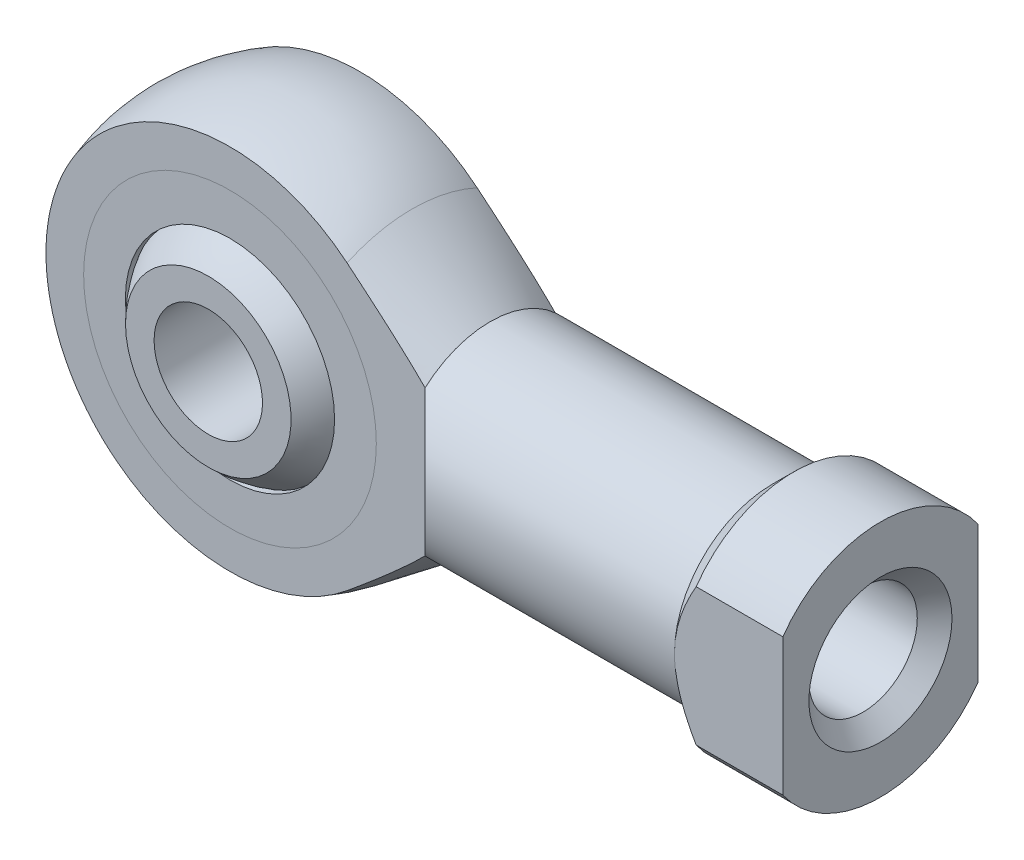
ISO-10303-21;
HEADER;
FILE_DESCRIPTION(('STEP AP214'),'2;1');
FILE_NAME('part.step','',(''),(''),'','','');
FILE_SCHEMA(('AUTOMOTIVE_DESIGN { 1 0 10303 214 1 1 1 1 }'));
ENDSEC;
DATA;
#1=APPLICATION_CONTEXT('core data for automotive mechanical design processes');
#2=APPLICATION_PROTOCOL_DEFINITION('international standard','automotive_design',2000,#1);
#3=PRODUCT_CONTEXT('',#1,'mechanical');
#4=PRODUCT('Part','Part','',(#3));
#5=PRODUCT_RELATED_PRODUCT_CATEGORY('part','',(#4));
#6=PRODUCT_DEFINITION_FORMATION('','',#4);
#7=PRODUCT_DEFINITION_CONTEXT('part definition',#1,'design');
#8=PRODUCT_DEFINITION('design','',#6,#7);
#9=PRODUCT_DEFINITION_SHAPE('','',#8);
#10=(LENGTH_UNIT() NAMED_UNIT(*) SI_UNIT(.MILLI.,.METRE.));
#11=(NAMED_UNIT(*) PLANE_ANGLE_UNIT() SI_UNIT($,.RADIAN.));
#12=(NAMED_UNIT(*) SI_UNIT($,.STERADIAN.) SOLID_ANGLE_UNIT());
#13=UNCERTAINTY_MEASURE_WITH_UNIT(LENGTH_MEASURE(1.E-05),#10,'distance_accuracy_value','');
#14=(GEOMETRIC_REPRESENTATION_CONTEXT(3) GLOBAL_UNCERTAINTY_ASSIGNED_CONTEXT((#13)) GLOBAL_UNIT_ASSIGNED_CONTEXT((#10,
#11,#12)) REPRESENTATION_CONTEXT('',''));
#15=CARTESIAN_POINT('',(0.,0.,0.));
#16=DIRECTION('',(0.,0.,1.));
#17=DIRECTION('',(1.,0.,0.));
#18=AXIS2_PLACEMENT_3D('',#15,#16,#17);
#19=CARTESIAN_POINT('',(0.,0.,0.));
#20=DIRECTION('',(0.,1.,0.));
#21=DIRECTION('',(1.,0.,0.));
#22=AXIS2_PLACEMENT_3D('',#19,#20,#21);
#23=SPHERICAL_SURFACE('',#22,5.53);
#24=CARTESIAN_POINT('',(0.,0.,0.));
#25=DIRECTION('',(0.,0.,-1.));
#26=DIRECTION('',(-1.,0.,0.));
#27=AXIS2_PLACEMENT_3D('',#24,#25,#26);
#28=SPHERICAL_SURFACE('',#27,5.53);
#29=CARTESIAN_POINT('',(0.,0.,4.));
#30=DIRECTION('',(0.,0.,-1.));
#31=DIRECTION('',(-1.,0.,0.));
#32=AXIS2_PLACEMENT_3D('',#29,#30,#31);
#33=CIRCLE('',#32,3.81849446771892);
#34=CARTESIAN_POINT('',(-3.81849446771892,0.,4.));
#35=VERTEX_POINT('',#34);
#36=EDGE_CURVE('P0_E26',#35,#35,#33,.F.);
#37=ORIENTED_EDGE('',*,*,#36,.F.);
#38=EDGE_LOOP('',(#37));
#39=FACE_BOUND('',#38,.T.);
#40=CARTESIAN_POINT('',(0.,0.,-4.));
#41=DIRECTION('',(0.,0.,1.));
#42=DIRECTION('',(1.,0.,0.));
#43=AXIS2_PLACEMENT_3D('',#40,#41,#42);
#44=CIRCLE('',#43,3.81849446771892);
#45=CARTESIAN_POINT('',(3.81849446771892,0.,-4.));
#46=VERTEX_POINT('',#45);
#47=EDGE_CURVE('P0_E10',#46,#46,#44,.F.);
#48=ORIENTED_EDGE('',*,*,#47,.F.);
#49=EDGE_LOOP('',(#48));
#50=FACE_BOUND('',#49,.T.);
#51=ADVANCED_FACE('P0_F14',(#39,#50),#28,.T.);
#52=CARTESIAN_POINT('',(0.,0.,-5.53));
#53=DIRECTION('',(0.,0.,1.));
#54=DIRECTION('',(1.,0.,0.));
#55=AXIS2_PLACEMENT_3D('',#52,#53,#54);
#56=CYLINDRICAL_SURFACE('',#55,2.5);
#57=CARTESIAN_POINT('',(0.,0.,4.));
#58=DIRECTION('',(0.,0.,-1.));
#59=DIRECTION('',(-1.,0.,0.));
#60=AXIS2_PLACEMENT_3D('',#57,#58,#59);
#61=CIRCLE('',#60,2.5);
#62=CARTESIAN_POINT('',(-2.5,0.,4.));
#63=VERTEX_POINT('',#62);
#64=EDGE_CURVE('P0_E17',#63,#63,#61,.F.);
#65=ORIENTED_EDGE('',*,*,#64,.T.);
#66=EDGE_LOOP('',(#65));
#67=FACE_BOUND('',#66,.T.);
#68=CARTESIAN_POINT('',(0.,0.,-4.));
#69=DIRECTION('',(0.,0.,1.));
#70=DIRECTION('',(1.,0.,0.));
#71=AXIS2_PLACEMENT_3D('',#68,#69,#70);
#72=CIRCLE('',#71,2.5);
#73=CARTESIAN_POINT('',(2.5,0.,-4.));
#74=VERTEX_POINT('',#73);
#75=EDGE_CURVE('P0_E21',#74,#74,#72,.F.);
#76=ORIENTED_EDGE('',*,*,#75,.T.);
#77=EDGE_LOOP('',(#76));
#78=FACE_BOUND('',#77,.T.);
#79=ADVANCED_FACE('P0_F34',(#67,#78),#56,.F.);
#80=CARTESIAN_POINT('',(-5.53,-5.53,-4.));
#81=DIRECTION('',(0.,0.,1.));
#82=DIRECTION('',(1.,0.,0.));
#83=AXIS2_PLACEMENT_3D('',#80,#81,#82);
#84=PLANE('',#83);
#85=ORIENTED_EDGE('',*,*,#47,.T.);
#86=EDGE_LOOP('',(#85));
#87=FACE_BOUND('',#86,.T.);
#88=ORIENTED_EDGE('',*,*,#75,.F.);
#89=EDGE_LOOP('',(#88));
#90=FACE_BOUND('',#89,.T.);
#91=ADVANCED_FACE('P0_F39',(#87,#90),#84,.F.);
#92=CARTESIAN_POINT('',(-5.53,-5.53,4.));
#93=DIRECTION('',(0.,0.,-1.));
#94=DIRECTION('',(-1.,0.,0.));
#95=AXIS2_PLACEMENT_3D('',#92,#93,#94);
#96=PLANE('',#95);
#97=ORIENTED_EDGE('',*,*,#36,.T.);
#98=EDGE_LOOP('',(#97));
#99=FACE_BOUND('',#98,.T.);
#100=ORIENTED_EDGE('',*,*,#64,.F.);
#101=EDGE_LOOP('',(#100));
#102=FACE_BOUND('',#101,.T.);
#103=ADVANCED_FACE('P0_F37',(#99,#102),#96,.F.);
#104=CLOSED_SHELL('',(#51,#79,#91,#103));
#105=MANIFOLD_SOLID_BREP('P0_B1',#104);
#106=CARTESIAN_POINT('',(0.,0.,3.));
#107=DIRECTION('',(0.,0.,1.));
#108=DIRECTION('',(1.,0.,0.));
#109=AXIS2_PLACEMENT_3D('',#106,#107,#108);
#110=PLANE('',#109);
#111=CARTESIAN_POINT('',(0.,0.,3.));
#112=DIRECTION('',(0.,0.,1.));
#113=DIRECTION('',(1.,0.,0.));
#114=AXIS2_PLACEMENT_3D('',#111,#112,#113);
#115=CIRCLE('',#114,6.75);
#116=CARTESIAN_POINT('',(6.75,0.,3.));
#117=VERTEX_POINT('',#116);
#118=EDGE_CURVE('P1_E10',#117,#117,#115,.T.);
#119=ORIENTED_EDGE('',*,*,#118,.T.);
#120=EDGE_LOOP('',(#119));
#121=FACE_BOUND('',#120,.T.);
#122=CARTESIAN_POINT('',(0.,0.,3.));
#123=DIRECTION('',(0.,0.,1.));
#124=DIRECTION('',(1.,0.,0.));
#125=AXIS2_PLACEMENT_3D('',#122,#123,#124);
#126=CIRCLE('',#125,4.825);
#127=CARTESIAN_POINT('',(4.825,0.,3.));
#128=VERTEX_POINT('',#127);
#129=EDGE_CURVE('P1_E25',#128,#128,#126,.T.);
#130=ORIENTED_EDGE('',*,*,#129,.F.);
#131=EDGE_LOOP('',(#130));
#132=FACE_BOUND('',#131,.T.);
#133=ADVANCED_FACE('P1_F14',(#121,#132),#110,.T.);
#134=CARTESIAN_POINT('',(0.,0.,2.7));
#135=DIRECTION('',(0.,0.,1.));
#136=DIRECTION('',(1.,0.,0.));
#137=AXIS2_PLACEMENT_3D('',#134,#135,#136);
#138=PLANE('',#137);
#139=CARTESIAN_POINT('',(0.,0.,2.7));
#140=DIRECTION('',(0.,0.,1.));
#141=DIRECTION('',(1.,0.,0.));
#142=AXIS2_PLACEMENT_3D('',#139,#140,#141);
#143=CIRCLE('',#142,6.75);
#144=CARTESIAN_POINT('',(6.75,0.,2.7));
#145=VERTEX_POINT('',#144);
#146=EDGE_CURVE('P1_E18',#145,#145,#143,.T.);
#147=ORIENTED_EDGE('',*,*,#146,.F.);
#148=EDGE_LOOP('',(#147));
#149=FACE_BOUND('',#148,.T.);
#150=CARTESIAN_POINT('',(0.,0.,2.7));
#151=DIRECTION('',(0.,0.,1.));
#152=DIRECTION('',(1.,0.,0.));
#153=AXIS2_PLACEMENT_3D('',#150,#151,#152);
#154=CIRCLE('',#153,4.825);
#155=CARTESIAN_POINT('',(4.825,0.,2.7));
#156=VERTEX_POINT('',#155);
#157=EDGE_CURVE('P1_E27',#156,#156,#154,.T.);
#158=ORIENTED_EDGE('',*,*,#157,.T.);
#159=EDGE_LOOP('',(#158));
#160=FACE_BOUND('',#159,.T.);
#161=ADVANCED_FACE('P1_F37',(#149,#160),#138,.F.);
#162=CARTESIAN_POINT('',(0.,0.,3.));
#163=DIRECTION('',(0.,0.,-1.));
#164=DIRECTION('',(-1.,0.,0.));
#165=AXIS2_PLACEMENT_3D('',#162,#163,#164);
#166=CYLINDRICAL_SURFACE('',#165,6.75);
#167=ORIENTED_EDGE('',*,*,#118,.F.);
#168=EDGE_LOOP('',(#167));
#169=FACE_BOUND('',#168,.T.);
#170=ORIENTED_EDGE('',*,*,#146,.T.);
#171=EDGE_LOOP('',(#170));
#172=FACE_BOUND('',#171,.T.);
#173=ADVANCED_FACE('P1_F16',(#169,#172),#166,.T.);
#174=CARTESIAN_POINT('',(0.,0.,3.));
#175=DIRECTION('',(0.,0.,-1.));
#176=DIRECTION('',(-1.,0.,0.));
#177=AXIS2_PLACEMENT_3D('',#174,#175,#176);
#178=CYLINDRICAL_SURFACE('',#177,4.825);
#179=ORIENTED_EDGE('',*,*,#129,.T.);
#180=EDGE_LOOP('',(#179));
#181=FACE_BOUND('',#180,.T.);
#182=ORIENTED_EDGE('',*,*,#157,.F.);
#183=EDGE_LOOP('',(#182));
#184=FACE_BOUND('',#183,.T.);
#185=ADVANCED_FACE('P1_F33',(#181,#184),#178,.F.);
#186=CLOSED_SHELL('',(#133,#161,#173,#185));
#187=MANIFOLD_SOLID_BREP('P1_B1',#186);
#188=CARTESIAN_POINT('',(0.,0.,-2.7));
#189=DIRECTION('',(0.,0.,1.));
#190=DIRECTION('',(1.,0.,0.));
#191=AXIS2_PLACEMENT_3D('',#188,#189,#190);
#192=PLANE('',#191);
#193=CARTESIAN_POINT('',(0.,0.,-2.7));
#194=DIRECTION('',(0.,0.,1.));
#195=DIRECTION('',(1.,0.,0.));
#196=AXIS2_PLACEMENT_3D('',#193,#194,#195);
#197=CIRCLE('',#196,6.75);
#198=CARTESIAN_POINT('',(6.75,0.,-2.7));
#199=VERTEX_POINT('',#198);
#200=EDGE_CURVE('P2_E10',#199,#199,#197,.T.);
#201=ORIENTED_EDGE('',*,*,#200,.T.);
#202=EDGE_LOOP('',(#201));
#203=FACE_BOUND('',#202,.T.);
#204=CARTESIAN_POINT('',(0.,0.,-2.7));
#205=DIRECTION('',(0.,0.,1.));
#206=DIRECTION('',(1.,0.,0.));
#207=AXIS2_PLACEMENT_3D('',#204,#205,#206);
#208=CIRCLE('',#207,4.825);
#209=CARTESIAN_POINT('',(4.825,0.,-2.7));
#210=VERTEX_POINT('',#209);
#211=EDGE_CURVE('P2_E25',#210,#210,#208,.T.);
#212=ORIENTED_EDGE('',*,*,#211,.F.);
#213=EDGE_LOOP('',(#212));
#214=FACE_BOUND('',#213,.T.);
#215=ADVANCED_FACE('P2_F14',(#203,#214),#192,.T.);
#216=CARTESIAN_POINT('',(0.,0.,-3.));
#217=DIRECTION('',(0.,0.,1.));
#218=DIRECTION('',(1.,0.,0.));
#219=AXIS2_PLACEMENT_3D('',#216,#217,#218);
#220=PLANE('',#219);
#221=CARTESIAN_POINT('',(0.,0.,-3.));
#222=DIRECTION('',(0.,0.,1.));
#223=DIRECTION('',(1.,0.,0.));
#224=AXIS2_PLACEMENT_3D('',#221,#222,#223);
#225=CIRCLE('',#224,6.75);
#226=CARTESIAN_POINT('',(6.75,0.,-3.));
#227=VERTEX_POINT('',#226);
#228=EDGE_CURVE('P2_E18',#227,#227,#225,.T.);
#229=ORIENTED_EDGE('',*,*,#228,.F.);
#230=EDGE_LOOP('',(#229));
#231=FACE_BOUND('',#230,.T.);
#232=CARTESIAN_POINT('',(0.,0.,-3.));
#233=DIRECTION('',(0.,0.,1.));
#234=DIRECTION('',(1.,0.,0.));
#235=AXIS2_PLACEMENT_3D('',#232,#233,#234);
#236=CIRCLE('',#235,4.825);
#237=CARTESIAN_POINT('',(4.825,0.,-3.));
#238=VERTEX_POINT('',#237);
#239=EDGE_CURVE('P2_E27',#238,#238,#236,.T.);
#240=ORIENTED_EDGE('',*,*,#239,.T.);
#241=EDGE_LOOP('',(#240));
#242=FACE_BOUND('',#241,.T.);
#243=ADVANCED_FACE('P2_F37',(#231,#242),#220,.F.);
#244=CARTESIAN_POINT('',(0.,0.,-2.7));
#245=DIRECTION('',(0.,0.,-1.));
#246=DIRECTION('',(-1.,0.,0.));
#247=AXIS2_PLACEMENT_3D('',#244,#245,#246);
#248=CYLINDRICAL_SURFACE('',#247,6.75);
#249=ORIENTED_EDGE('',*,*,#200,.F.);
#250=EDGE_LOOP('',(#249));
#251=FACE_BOUND('',#250,.T.);
#252=ORIENTED_EDGE('',*,*,#228,.T.);
#253=EDGE_LOOP('',(#252));
#254=FACE_BOUND('',#253,.T.);
#255=ADVANCED_FACE('P2_F16',(#251,#254),#248,.T.);
#256=CARTESIAN_POINT('',(0.,0.,-2.7));
#257=DIRECTION('',(0.,0.,-1.));
#258=DIRECTION('',(-1.,0.,0.));
#259=AXIS2_PLACEMENT_3D('',#256,#257,#258);
#260=CYLINDRICAL_SURFACE('',#259,4.825);
#261=ORIENTED_EDGE('',*,*,#211,.T.);
#262=EDGE_LOOP('',(#261));
#263=FACE_BOUND('',#262,.T.);
#264=ORIENTED_EDGE('',*,*,#239,.F.);
#265=EDGE_LOOP('',(#264));
#266=FACE_BOUND('',#265,.T.);
#267=ADVANCED_FACE('P2_F33',(#263,#266),#260,.F.);
#268=CLOSED_SHELL('',(#215,#243,#255,#267));
#269=MANIFOLD_SOLID_BREP('P2_B1',#268);
#270=CARTESIAN_POINT('',(0.,0.,0.));
#271=DIRECTION('',(0.,1.,0.));
#272=DIRECTION('',(1.,0.,0.));
#273=AXIS2_PLACEMENT_3D('',#270,#271,#272);
#274=SPHERICAL_SURFACE('',#273,5.53);
#275=CARTESIAN_POINT('',(0.,0.,0.));
#276=DIRECTION('',(0.,0.,1.));
#277=DIRECTION('',(1.,0.,0.));
#278=AXIS2_PLACEMENT_3D('',#275,#276,#277);
#279=SPHERICAL_SURFACE('',#278,5.53);
#280=CARTESIAN_POINT('',(0.,0.,2.7));
#281=DIRECTION('',(0.,0.,1.));
#282=DIRECTION('',(1.,0.,0.));
#283=AXIS2_PLACEMENT_3D('',#280,#281,#282);
#284=CIRCLE('',#283,4.82606464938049);
#285=CARTESIAN_POINT('',(4.82606464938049,0.,2.7));
#286=VERTEX_POINT('',#285);
#287=EDGE_CURVE('P3_E73',#286,#286,#284,.F.);
#288=ORIENTED_EDGE('',*,*,#287,.F.);
#289=EDGE_LOOP('',(#288));
#290=FACE_BOUND('',#289,.T.);
#291=CARTESIAN_POINT('',(0.,0.,-2.7));
#292=DIRECTION('',(0.,0.,-1.));
#293=DIRECTION('',(-1.,0.,0.));
#294=AXIS2_PLACEMENT_3D('',#291,#292,#293);
#295=CIRCLE('',#294,4.82606464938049);
#296=CARTESIAN_POINT('',(-4.82606464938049,0.,-2.7));
#297=VERTEX_POINT('',#296);
#298=EDGE_CURVE('P3_E20',#297,#297,#295,.F.);
#299=ORIENTED_EDGE('',*,*,#298,.F.);
#300=EDGE_LOOP('',(#299));
#301=FACE_BOUND('',#300,.T.);
#302=ADVANCED_FACE('P3_F16',(#290,#301),#279,.F.);
#303=CARTESIAN_POINT('',(-9.,-9.,-3.));
#304=DIRECTION('',(0.,0.,1.));
#305=DIRECTION('',(1.,0.,0.));
#306=AXIS2_PLACEMENT_3D('',#303,#304,#305);
#307=PLANE('',#306);
#308=CARTESIAN_POINT('',(0.,0.,-3.));
#309=DIRECTION('',(0.,0.,1.));
#310=DIRECTION('',(1.,0.,0.));
#311=AXIS2_PLACEMENT_3D('',#308,#309,#310);
#312=CIRCLE('',#311,8.48528137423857);
#313=CARTESIAN_POINT('',(5.4,6.54522726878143,-3.));
#314=VERTEX_POINT('',#313);
#315=CARTESIAN_POINT('',(5.4,-6.54522726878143,-3.));
#316=VERTEX_POINT('',#315);
#317=EDGE_CURVE('P3_E11',#314,#316,#312,.T.);
#318=ORIENTED_EDGE('',*,*,#317,.F.);
#319=CARTESIAN_POINT('',(-14.2271365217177,-21.7140933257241,-2.99999999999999));
#320=CARTESIAN_POINT('',(-13.2892236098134,-21.003931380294,-2.99999999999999));
#321=CARTESIAN_POINT('',(-12.3515831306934,-20.2934084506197,-2.99999999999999));
#322=CARTESIAN_POINT('',(-10.4771127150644,-18.8711801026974,-3.));
#323=CARTESIAN_POINT('',(-9.54028282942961,-18.1594746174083,-3.));
#324=CARTESIAN_POINT('',(-7.6661158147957,-16.7332150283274,-3.));
#325=CARTESIAN_POINT('',(-6.72878083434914,-16.0186581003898,-3.));
#326=CARTESIAN_POINT('',(-4.85591491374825,-14.5872872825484,-3.));
#327=CARTESIAN_POINT('',(-3.92038387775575,-13.870473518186,-3.));
#328=CARTESIAN_POINT('',(-2.54758468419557,-12.8144159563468,-3.));
#329=CARTESIAN_POINT('',(-2.10923729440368,-12.4765753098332,-3.));
#330=CARTESIAN_POINT('',(-1.23332717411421,-11.7998786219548,-3.));
#331=CARTESIAN_POINT('',(-0.7957644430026,-11.4610225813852,-3.));
#332=CARTESIAN_POINT('',(0.0784201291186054,-10.7819498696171,-3.));
#333=CARTESIAN_POINT('',(0.515041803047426,-10.4417329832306,-3.));
#334=CARTESIAN_POINT('',(1.38693518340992,-9.75958206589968,-3.));
#335=CARTESIAN_POINT('',(1.82220690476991,-9.41764805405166,-3.));
#336=CARTESIAN_POINT('',(2.69048820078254,-8.73177410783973,-3.));
#337=CARTESIAN_POINT('',(3.12349954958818,-8.38783642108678,-3.));
#338=CARTESIAN_POINT('',(3.98693879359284,-7.69668310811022,-3.));
#339=CARTESIAN_POINT('',(4.4173665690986,-7.34946733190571,-3.));
#340=CARTESIAN_POINT('',(5.06000268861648,-6.82507687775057,-3.));
#341=CARTESIAN_POINT('',(5.27368525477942,-6.64970943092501,-3.));
#342=CARTESIAN_POINT('',(5.69980714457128,-6.29747154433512,-3.));
#343=CARTESIAN_POINT('',(5.91224647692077,-6.12060111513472,-3.));
#344=CARTESIAN_POINT('',(6.33552363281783,-5.76498625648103,-3.));
#345=CARTESIAN_POINT('',(6.54636158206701,-5.5862419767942,-3.));
#346=CARTESIAN_POINT('',(6.96596428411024,-5.22633919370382,-3.));
#347=CARTESIAN_POINT('',(7.17472909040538,-5.045180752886,-3.));
#348=CARTESIAN_POINT('',(7.46338063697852,-4.79079938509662,-3.));
#349=CARTESIAN_POINT('',(7.54445190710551,-4.71891986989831,-3.));
#350=CARTESIAN_POINT('',(7.70610379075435,-4.57460934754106,-3.));
#351=CARTESIAN_POINT('',(7.78668439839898,-4.50217833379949,-3.));
#352=CARTESIAN_POINT('',(8.02761622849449,-4.28393841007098,-3.));
#353=CARTESIAN_POINT('',(8.1871326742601,-4.13720438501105,-3.));
#354=CARTESIAN_POINT('',(8.50539873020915,-3.83853427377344,-3.));
#355=CARTESIAN_POINT('',(8.66410736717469,-3.68655434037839,-3.));
#356=CARTESIAN_POINT('',(8.97728354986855,-3.37839862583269,-3.));
#357=CARTESIAN_POINT('',(9.13175281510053,-3.2222245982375,-3.));
#358=CARTESIAN_POINT('',(9.43704622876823,-2.90176145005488,-3.));
#359=CARTESIAN_POINT('',(9.5877806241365,-2.73738560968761,-3.));
#360=CARTESIAN_POINT('',(9.80702886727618,-2.4845468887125,-3.));
#361=CARTESIAN_POINT('',(9.87904453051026,-2.39912443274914,-3.));
#362=CARTESIAN_POINT('',(10.020093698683,-2.22585311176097,-3.));
#363=CARTESIAN_POINT('',(10.0891275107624,-2.13800449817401,-3.));
#364=CARTESIAN_POINT('',(10.2224359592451,-1.96071664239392,-3.));
#365=CARTESIAN_POINT('',(10.2867646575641,-1.87131829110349,-3.));
#366=CARTESIAN_POINT('',(10.4106749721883,-1.68921770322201,-3.));
#367=CARTESIAN_POINT('',(10.4702550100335,-1.59651438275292,-3.));
#368=CARTESIAN_POINT('',(10.5829440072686,-1.40772462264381,-3.));
#369=CARTESIAN_POINT('',(10.6360780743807,-1.31165332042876,-3.));
#370=CARTESIAN_POINT('',(10.7341764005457,-1.11544076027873,-3.));
#371=CARTESIAN_POINT('',(10.7791472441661,-1.01530286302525,-3.));
#372=CARTESIAN_POINT('',(10.8471079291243,-0.840247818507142,-3.));
#373=CARTESIAN_POINT('',(10.8727015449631,-0.766345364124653,-3.));
#374=CARTESIAN_POINT('',(10.917542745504,-0.616604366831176,-3.));
#375=CARTESIAN_POINT('',(10.9367897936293,-0.540765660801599,-3.));
#376=CARTESIAN_POINT('',(10.9679640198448,-0.387845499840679,-3.));
#377=CARTESIAN_POINT('',(10.979915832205,-0.310769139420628,-3.));
#378=CARTESIAN_POINT('',(10.9959336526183,-0.155795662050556,-3.));
#379=CARTESIAN_POINT('',(11.0000004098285,-0.0778986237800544,-3.));
#380=CARTESIAN_POINT('',(10.9999995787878,0.0800623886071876,-3.));
#381=CARTESIAN_POINT('',(10.9957029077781,0.160126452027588,-3.));
#382=CARTESIAN_POINT('',(10.978792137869,0.319363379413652,-3.));
#383=CARTESIAN_POINT('',(10.9661771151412,0.398536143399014,-3.));
#384=CARTESIAN_POINT('',(10.9333134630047,0.555543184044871,-3.));
#385=CARTESIAN_POINT('',(10.91303858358,0.633371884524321,-3.));
#386=CARTESIAN_POINT('',(10.865853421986,0.787005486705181,-3.));
#387=CARTESIAN_POINT('',(10.8389394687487,0.86280924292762,-3.));
#388=CARTESIAN_POINT('',(10.765436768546,1.0476373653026,-3.));
#389=CARTESIAN_POINT('',(10.7155724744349,1.15535464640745,-3.));
#390=CARTESIAN_POINT('',(10.6067368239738,1.36606414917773,-3.));
#391=CARTESIAN_POINT('',(10.5477592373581,1.46905307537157,-3.));
#392=CARTESIAN_POINT('',(10.4228166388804,1.67115493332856,-3.));
#393=CARTESIAN_POINT('',(10.3568281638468,1.77025322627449,-3.));
#394=CARTESIAN_POINT('',(10.2540256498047,1.91614177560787,-3.));
#395=CARTESIAN_POINT('',(10.219127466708,1.9643039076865,-3.));
#396=CARTESIAN_POINT('',(10.1482090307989,2.05979424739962,-3.));
#397=CARTESIAN_POINT('',(10.1121888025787,2.10712247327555,-3.));
#398=CARTESIAN_POINT('',(9.99545069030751,2.25724182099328,-3.));
#399=CARTESIAN_POINT('',(9.91286148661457,2.35857954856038,-3.));
#400=CARTESIAN_POINT('',(9.74411408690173,2.55824989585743,-3.));
#401=CARTESIAN_POINT('',(9.65795510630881,2.65658184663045,-3.));
#402=CARTESIAN_POINT('',(9.48282172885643,2.85082537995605,-3.));
#403=CARTESIAN_POINT('',(9.3938453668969,2.94673518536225,-3.));
#404=CARTESIAN_POINT('',(9.21371170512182,3.1364886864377,-3.));
#405=CARTESIAN_POINT('',(9.12255425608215,3.23033223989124,-3.));
#406=CARTESIAN_POINT('',(8.84599285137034,3.50978519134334,-3.));
#407=CARTESIAN_POINT('',(8.65797188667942,3.69280289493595,-3.));
#408=CARTESIAN_POINT('',(8.27737424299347,4.05383600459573,-3.));
#409=CARTESIAN_POINT('',(8.08479943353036,4.23185340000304,-3.));
#410=CARTESIAN_POINT('',(7.69482184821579,4.58564534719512,-3.));
#411=CARTESIAN_POINT('',(7.49739292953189,4.76139101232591,-3.));
#412=CARTESIAN_POINT('',(7.10007160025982,5.11010485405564,-3.));
#413=CARTESIAN_POINT('',(6.90017895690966,5.28307276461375,-3.));
#414=CARTESIAN_POINT('',(6.49890410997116,5.62653878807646,-3.));
#415=CARTESIAN_POINT('',(6.29752520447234,5.79704076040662,-3.));
#416=CARTESIAN_POINT('',(5.89334430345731,6.13633198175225,-3.));
#417=CARTESIAN_POINT('',(5.69054235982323,6.30512129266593,-3.));
#418=CARTESIAN_POINT('',(5.07628445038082,6.81290094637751,-3.));
#419=CARTESIAN_POINT('',(4.66310034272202,7.14979978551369,-3.));
#420=CARTESIAN_POINT('',(3.83374316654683,7.81990222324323,-3.));
#421=CARTESIAN_POINT('',(3.41757003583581,8.15310574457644,-3.));
#422=CARTESIAN_POINT('',(2.58311203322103,8.81691442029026,-3.));
#423=CARTESIAN_POINT('',(2.16482701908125,9.14751939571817,-3.));
#424=CARTESIAN_POINT('',(1.32675019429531,9.80681438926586,-3.));
#425=CARTESIAN_POINT('',(0.906958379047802,10.1355044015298,-3.));
#426=CARTESIAN_POINT('',(0.0658270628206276,10.7917694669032,-3.));
#427=CARTESIAN_POINT('',(-0.355513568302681,11.1193430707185,-3.));
#428=CARTESIAN_POINT('',(-1.19906331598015,11.7733712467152,-3.));
#429=CARTESIAN_POINT('',(-1.62127243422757,12.0998258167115,-3.));
#430=CARTESIAN_POINT('',(-2.88887532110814,13.0778542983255,-3.));
#431=CARTESIAN_POINT('',(-3.73527867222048,13.7281194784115,-3.));
#432=CARTESIAN_POINT('',(-5.384650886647,14.9917790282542,-3.));
#433=CARTESIAN_POINT('',(-6.18752979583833,15.6052909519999,-3.));
#434=CARTESIAN_POINT('',(-7.79439465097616,16.8308839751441,-3.));
#435=CARTESIAN_POINT('',(-8.59838061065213,17.4429650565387,-3.));
#436=CARTESIAN_POINT('',(-10.206163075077,18.6653367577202,-3.));
#437=CARTESIAN_POINT('',(-11.0099586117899,19.2756286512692,-3.));
#438=CARTESIAN_POINT('',(-12.6181446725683,20.4954044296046,-2.99999999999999));
#439=CARTESIAN_POINT('',(-13.4225351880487,21.1048883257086,-2.99999999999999));
#440=CARTESIAN_POINT('',(-14.2271365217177,21.7140933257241,-2.99999999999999));
#441=B_SPLINE_CURVE_WITH_KNOTS('',3,(#319,#320,#321,#322,#323,#324,#325,#326,#327,#328,#329,
#330,#331,#332,#333,#334,#335,#336,#337,#338,#339,#340,#341,#342,#343,#344,#345,#346,#347,#348,
#349,#350,#351,#352,#353,#354,#355,#356,#357,#358,#359,#360,#361,#362,#363,#364,#365,#366,#367,
#368,#369,#370,#371,#372,#373,#374,#375,#376,#377,#378,#379,#380,#381,#382,#383,#384,#385,#386,
#387,#388,#389,#390,#391,#392,#393,#394,#395,#396,#397,#398,#399,#400,#401,#402,#403,#404,#405,
#406,#407,#408,#409,#410,#411,#412,#413,#414,#415,#416,#417,#418,#419,#420,#421,#422,#423,#424,
#425,#426,#427,#428,#429,#430,#431,#432,#433,#434,#435,#436,#437,#438,#439,#440),.UNSPECIFIED.,
.F.,.F.,(4,2,2,2,2,2,2,2,2,2,2,2,2,2,2,2,2,2,2,2,2,2,2,2,2,2,2,2,2,2,2,2,2,2,2,2,2,2,2,2,2,2,2,
2,2,2,2,2,2,2,2,2,2,2,2,2,2,2,2,2,4),(0.,3.52932045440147,7.05884832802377,10.5947616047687,
14.1304815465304,15.7907703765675,17.4510579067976,19.1116192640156,20.7721621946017,
22.4311067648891,24.0901276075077,24.919414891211,25.7486963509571,26.5779120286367,
27.4071062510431,27.7321470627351,28.057191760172,28.7073801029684,29.3665426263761,
30.025433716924,30.6942336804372,31.0293689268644,31.3644695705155,31.6947635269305,
32.0251668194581,32.3542387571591,32.6830440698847,32.9174334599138,33.1518426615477,
33.3854558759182,33.6190468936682,33.8591262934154,34.0992323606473,34.3401688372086,
34.5812388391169,34.9367154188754,35.2924361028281,35.6493871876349,35.8278050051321,
36.0062189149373,36.398287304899,36.7904423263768,37.1828771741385,37.5753389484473,
38.3623545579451,39.1490524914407,39.9419743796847,40.7349717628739,41.5265528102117,
42.3181051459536,43.9174414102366,45.5168110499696,47.1162898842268,48.7157736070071,
50.3168619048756,51.9179533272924,55.1200067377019,58.1513583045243,61.18274781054,
64.2104347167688,67.2380787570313),.UNSPECIFIED.);
#442=CARTESIAN_POINT('',(9.,3.35410196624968,-3.));
#443=VERTEX_POINT('',#442);
#444=EDGE_CURVE('P3_E102',#443,#314,#441,.T.);
#445=ORIENTED_EDGE('',*,*,#444,.F.);
#446=DIRECTION('',(0.,1.,0.));
#447=VECTOR('',#446,1.);
#448=CARTESIAN_POINT('',(9.,-9.,-3.));
#449=LINE('',#448,#447);
#450=CARTESIAN_POINT('',(9.,-3.35410196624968,-3.));
#451=VERTEX_POINT('',#450);
#452=EDGE_CURVE('P3_E64',#451,#443,#449,.T.);
#453=ORIENTED_EDGE('',*,*,#452,.F.);
#454=EDGE_CURVE('P3_E33',#316,#451,#441,.T.);
#455=ORIENTED_EDGE('',*,*,#454,.F.);
#456=EDGE_LOOP('',(#318,#445,#453,#455));
#457=FACE_BOUND('',#456,.T.);
#458=CARTESIAN_POINT('',(0.,0.,-3.));
#459=DIRECTION('',(0.,0.,1.));
#460=DIRECTION('',(1.,0.,0.));
#461=AXIS2_PLACEMENT_3D('',#458,#459,#460);
#462=CIRCLE('',#461,6.75);
#463=CARTESIAN_POINT('',(6.75,0.,-3.));
#464=VERTEX_POINT('',#463);
#465=EDGE_CURVE('P3_E95',#464,#464,#462,.T.);
#466=ORIENTED_EDGE('',*,*,#465,.T.);
#467=EDGE_LOOP('',(#466));
#468=FACE_BOUND('',#467,.T.);
#469=ADVANCED_FACE('P3_F115',(#457,#468),#307,.F.);
#470=CARTESIAN_POINT('',(9.,0.,0.));
#471=DIRECTION('',(-1.,0.,0.));
#472=DIRECTION('',(0.,0.,1.));
#473=AXIS2_PLACEMENT_3D('',#470,#471,#472);
#474=CONICAL_SURFACE('',#473,4.5,0.643501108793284);
#475=CARTESIAN_POINT('',(5.4,0.,0.));
#476=DIRECTION('',(-1.,0.,0.));
#477=DIRECTION('',(0.,0.,1.));
#478=AXIS2_PLACEMENT_3D('',#475,#476,#477);
#479=CIRCLE('',#478,7.2);
#480=CARTESIAN_POINT('',(5.4,-6.54522726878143,3.));
#481=VERTEX_POINT('',#480);
#482=EDGE_CURVE('P3_E79',#316,#481,#479,.T.);
#483=ORIENTED_EDGE('',*,*,#482,.F.);
#484=ORIENTED_EDGE('',*,*,#454,.T.);
#485=CARTESIAN_POINT('',(9.,0.,0.));
#486=DIRECTION('',(-1.,0.,0.));
#487=DIRECTION('',(0.,0.,1.));
#488=AXIS2_PLACEMENT_3D('',#485,#486,#487);
#489=CIRCLE('',#488,4.5);
#490=CARTESIAN_POINT('',(9.,-3.35410196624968,3.));
#491=VERTEX_POINT('',#490);
#492=EDGE_CURVE('P3_E70',#451,#491,#489,.T.);
#493=ORIENTED_EDGE('',*,*,#492,.T.);
#494=CARTESIAN_POINT('',(-14.2271365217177,21.7140933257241,2.99999999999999));
#495=CARTESIAN_POINT('',(-13.2892236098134,21.003931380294,2.99999999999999));
#496=CARTESIAN_POINT('',(-12.3515831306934,20.2934084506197,2.99999999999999));
#497=CARTESIAN_POINT('',(-10.4771127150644,18.8711801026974,3.));
#498=CARTESIAN_POINT('',(-9.54028282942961,18.1594746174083,3.));
#499=CARTESIAN_POINT('',(-7.6661158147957,16.7332150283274,3.));
#500=CARTESIAN_POINT('',(-6.72878083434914,16.0186581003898,3.));
#501=CARTESIAN_POINT('',(-4.85591491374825,14.5872872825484,3.));
#502=CARTESIAN_POINT('',(-3.92038387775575,13.870473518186,3.));
#503=CARTESIAN_POINT('',(-2.54758468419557,12.8144159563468,3.));
#504=CARTESIAN_POINT('',(-2.10923729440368,12.4765753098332,3.));
#505=CARTESIAN_POINT('',(-1.23332717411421,11.7998786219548,3.));
#506=CARTESIAN_POINT('',(-0.7957644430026,11.4610225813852,3.));
#507=CARTESIAN_POINT('',(0.0784201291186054,10.7819498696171,3.));
#508=CARTESIAN_POINT('',(0.515041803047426,10.4417329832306,3.));
#509=CARTESIAN_POINT('',(1.38693518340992,9.75958206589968,3.));
#510=CARTESIAN_POINT('',(1.82220690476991,9.41764805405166,3.));
#511=CARTESIAN_POINT('',(2.69048820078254,8.73177410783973,3.));
#512=CARTESIAN_POINT('',(3.12349954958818,8.38783642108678,3.));
#513=CARTESIAN_POINT('',(3.98693879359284,7.69668310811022,3.));
#514=CARTESIAN_POINT('',(4.4173665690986,7.34946733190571,3.));
#515=CARTESIAN_POINT('',(5.06000268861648,6.82507687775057,3.));
#516=CARTESIAN_POINT('',(5.27368525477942,6.64970943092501,3.));
#517=CARTESIAN_POINT('',(5.69980714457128,6.29747154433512,3.));
#518=CARTESIAN_POINT('',(5.91224647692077,6.12060111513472,3.));
#519=CARTESIAN_POINT('',(6.33552363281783,5.76498625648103,3.));
#520=CARTESIAN_POINT('',(6.54636158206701,5.5862419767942,3.));
#521=CARTESIAN_POINT('',(6.96596428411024,5.22633919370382,3.));
#522=CARTESIAN_POINT('',(7.17472909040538,5.045180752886,3.));
#523=CARTESIAN_POINT('',(7.46338063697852,4.79079938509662,3.));
#524=CARTESIAN_POINT('',(7.54445190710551,4.71891986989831,3.));
#525=CARTESIAN_POINT('',(7.70610379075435,4.57460934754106,3.));
#526=CARTESIAN_POINT('',(7.78668439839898,4.50217833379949,3.));
#527=CARTESIAN_POINT('',(8.02761622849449,4.28393841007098,3.));
#528=CARTESIAN_POINT('',(8.1871326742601,4.13720438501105,3.));
#529=CARTESIAN_POINT('',(8.50539873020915,3.83853427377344,3.));
#530=CARTESIAN_POINT('',(8.66410736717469,3.68655434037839,3.));
#531=CARTESIAN_POINT('',(8.97728354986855,3.37839862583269,3.));
#532=CARTESIAN_POINT('',(9.13175281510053,3.2222245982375,3.));
#533=CARTESIAN_POINT('',(9.43704622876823,2.90176145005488,3.));
#534=CARTESIAN_POINT('',(9.5877806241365,2.73738560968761,3.));
#535=CARTESIAN_POINT('',(9.80702886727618,2.4845468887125,3.));
#536=CARTESIAN_POINT('',(9.87904453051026,2.39912443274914,3.));
#537=CARTESIAN_POINT('',(10.020093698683,2.22585311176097,3.));
#538=CARTESIAN_POINT('',(10.0891275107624,2.13800449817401,3.));
#539=CARTESIAN_POINT('',(10.2224359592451,1.96071664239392,3.));
#540=CARTESIAN_POINT('',(10.2867646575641,1.87131829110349,3.));
#541=CARTESIAN_POINT('',(10.4106749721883,1.68921770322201,3.));
#542=CARTESIAN_POINT('',(10.4702550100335,1.59651438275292,3.));
#543=CARTESIAN_POINT('',(10.5829440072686,1.40772462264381,3.));
#544=CARTESIAN_POINT('',(10.6360780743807,1.31165332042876,3.));
#545=CARTESIAN_POINT('',(10.7341764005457,1.11544076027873,3.));
#546=CARTESIAN_POINT('',(10.7791472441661,1.01530286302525,3.));
#547=CARTESIAN_POINT('',(10.8471079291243,0.840247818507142,3.));
#548=CARTESIAN_POINT('',(10.8727015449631,0.766345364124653,3.));
#549=CARTESIAN_POINT('',(10.917542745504,0.616604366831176,3.));
#550=CARTESIAN_POINT('',(10.9367897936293,0.540765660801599,3.));
#551=CARTESIAN_POINT('',(10.9679640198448,0.387845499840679,3.));
#552=CARTESIAN_POINT('',(10.979915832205,0.310769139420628,3.));
#553=CARTESIAN_POINT('',(10.9959336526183,0.155795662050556,3.));
#554=CARTESIAN_POINT('',(11.0000004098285,0.0778986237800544,3.));
#555=CARTESIAN_POINT('',(10.9999995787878,-0.0800623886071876,3.));
#556=CARTESIAN_POINT('',(10.9957029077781,-0.160126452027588,3.));
#557=CARTESIAN_POINT('',(10.978792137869,-0.319363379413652,3.));
#558=CARTESIAN_POINT('',(10.9661771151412,-0.398536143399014,3.));
#559=CARTESIAN_POINT('',(10.9333134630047,-0.555543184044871,3.));
#560=CARTESIAN_POINT('',(10.91303858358,-0.633371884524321,3.));
#561=CARTESIAN_POINT('',(10.865853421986,-0.787005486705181,3.));
#562=CARTESIAN_POINT('',(10.8389394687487,-0.86280924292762,3.));
#563=CARTESIAN_POINT('',(10.765436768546,-1.0476373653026,3.));
#564=CARTESIAN_POINT('',(10.7155724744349,-1.15535464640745,3.));
#565=CARTESIAN_POINT('',(10.6067368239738,-1.36606414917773,3.));
#566=CARTESIAN_POINT('',(10.5477592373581,-1.46905307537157,3.));
#567=CARTESIAN_POINT('',(10.4228166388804,-1.67115493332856,3.));
#568=CARTESIAN_POINT('',(10.3568281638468,-1.77025322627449,3.));
#569=CARTESIAN_POINT('',(10.2540256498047,-1.91614177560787,3.));
#570=CARTESIAN_POINT('',(10.219127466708,-1.9643039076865,3.));
#571=CARTESIAN_POINT('',(10.1482090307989,-2.05979424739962,3.));
#572=CARTESIAN_POINT('',(10.1121888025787,-2.10712247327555,3.));
#573=CARTESIAN_POINT('',(9.99545069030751,-2.25724182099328,3.));
#574=CARTESIAN_POINT('',(9.91286148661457,-2.35857954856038,3.));
#575=CARTESIAN_POINT('',(9.74411408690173,-2.55824989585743,3.));
#576=CARTESIAN_POINT('',(9.65795510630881,-2.65658184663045,3.));
#577=CARTESIAN_POINT('',(9.48282172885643,-2.85082537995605,3.));
#578=CARTESIAN_POINT('',(9.3938453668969,-2.94673518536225,3.));
#579=CARTESIAN_POINT('',(9.21371170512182,-3.1364886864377,3.));
#580=CARTESIAN_POINT('',(9.12255425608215,-3.23033223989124,3.));
#581=CARTESIAN_POINT('',(8.84599285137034,-3.50978519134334,3.));
#582=CARTESIAN_POINT('',(8.65797188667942,-3.69280289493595,3.));
#583=CARTESIAN_POINT('',(8.27737424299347,-4.05383600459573,3.));
#584=CARTESIAN_POINT('',(8.08479943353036,-4.23185340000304,3.));
#585=CARTESIAN_POINT('',(7.69482184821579,-4.58564534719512,3.));
#586=CARTESIAN_POINT('',(7.49739292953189,-4.76139101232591,3.));
#587=CARTESIAN_POINT('',(7.10007160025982,-5.11010485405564,3.));
#588=CARTESIAN_POINT('',(6.90017895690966,-5.28307276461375,3.));
#589=CARTESIAN_POINT('',(6.49890410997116,-5.62653878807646,3.));
#590=CARTESIAN_POINT('',(6.29752520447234,-5.79704076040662,3.));
#591=CARTESIAN_POINT('',(5.89334430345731,-6.13633198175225,3.));
#592=CARTESIAN_POINT('',(5.69054235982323,-6.30512129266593,3.));
#593=CARTESIAN_POINT('',(5.07628445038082,-6.81290094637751,3.));
#594=CARTESIAN_POINT('',(4.66310034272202,-7.14979978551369,3.));
#595=CARTESIAN_POINT('',(3.83374316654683,-7.81990222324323,3.));
#596=CARTESIAN_POINT('',(3.41757003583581,-8.15310574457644,3.));
#597=CARTESIAN_POINT('',(2.58311203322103,-8.81691442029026,3.));
#598=CARTESIAN_POINT('',(2.16482701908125,-9.14751939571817,3.));
#599=CARTESIAN_POINT('',(1.32675019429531,-9.80681438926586,3.));
#600=CARTESIAN_POINT('',(0.906958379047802,-10.1355044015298,3.));
#601=CARTESIAN_POINT('',(0.0658270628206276,-10.7917694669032,3.));
#602=CARTESIAN_POINT('',(-0.355513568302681,-11.1193430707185,3.));
#603=CARTESIAN_POINT('',(-1.19906331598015,-11.7733712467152,3.));
#604=CARTESIAN_POINT('',(-1.62127243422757,-12.0998258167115,3.));
#605=CARTESIAN_POINT('',(-2.88887532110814,-13.0778542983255,3.));
#606=CARTESIAN_POINT('',(-3.73527867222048,-13.7281194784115,3.));
#607=CARTESIAN_POINT('',(-5.384650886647,-14.9917790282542,3.));
#608=CARTESIAN_POINT('',(-6.18752979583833,-15.6052909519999,3.));
#609=CARTESIAN_POINT('',(-7.79439465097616,-16.8308839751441,3.));
#610=CARTESIAN_POINT('',(-8.59838061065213,-17.4429650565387,3.));
#611=CARTESIAN_POINT('',(-10.206163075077,-18.6653367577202,3.));
#612=CARTESIAN_POINT('',(-11.0099586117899,-19.2756286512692,3.));
#613=CARTESIAN_POINT('',(-12.6181446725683,-20.4954044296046,2.99999999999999));
#614=CARTESIAN_POINT('',(-13.4225351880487,-21.1048883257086,2.99999999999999));
#615=CARTESIAN_POINT('',(-14.2271365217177,-21.7140933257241,2.99999999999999));
#616=B_SPLINE_CURVE_WITH_KNOTS('',3,(#494,#495,#496,#497,#498,#499,#500,#501,#502,#503,#504,
#505,#506,#507,#508,#509,#510,#511,#512,#513,#514,#515,#516,#517,#518,#519,#520,#521,#522,#523,
#524,#525,#526,#527,#528,#529,#530,#531,#532,#533,#534,#535,#536,#537,#538,#539,#540,#541,#542,
#543,#544,#545,#546,#547,#548,#549,#550,#551,#552,#553,#554,#555,#556,#557,#558,#559,#560,#561,
#562,#563,#564,#565,#566,#567,#568,#569,#570,#571,#572,#573,#574,#575,#576,#577,#578,#579,#580,
#581,#582,#583,#584,#585,#586,#587,#588,#589,#590,#591,#592,#593,#594,#595,#596,#597,#598,#599,
#600,#601,#602,#603,#604,#605,#606,#607,#608,#609,#610,#611,#612,#613,#614,#615),.UNSPECIFIED.,
.F.,.F.,(4,2,2,2,2,2,2,2,2,2,2,2,2,2,2,2,2,2,2,2,2,2,2,2,2,2,2,2,2,2,2,2,2,2,2,2,2,2,2,2,2,2,2,
2,2,2,2,2,2,2,2,2,2,2,2,2,2,2,2,2,4),(0.,3.52932045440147,7.05884832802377,10.5947616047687,
14.1304815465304,15.7907703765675,17.4510579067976,19.1116192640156,20.7721621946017,
22.4311067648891,24.0901276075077,24.919414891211,25.7486963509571,26.5779120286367,
27.4071062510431,27.7321470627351,28.057191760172,28.7073801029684,29.3665426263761,
30.025433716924,30.6942336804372,31.0293689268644,31.3644695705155,31.6947635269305,
32.0251668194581,32.3542387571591,32.6830440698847,32.9174334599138,33.1518426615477,
33.3854558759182,33.6190468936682,33.8591262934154,34.0992323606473,34.3401688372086,
34.5812388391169,34.9367154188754,35.2924361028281,35.6493871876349,35.8278050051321,
36.0062189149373,36.398287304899,36.7904423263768,37.1828771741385,37.5753389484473,
38.3623545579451,39.1490524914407,39.9419743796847,40.7349717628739,41.5265528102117,
42.3181051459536,43.9174414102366,45.5168110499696,47.1162898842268,48.7157736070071,
50.3168619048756,51.9179533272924,55.1200067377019,58.1513583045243,61.18274781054,
64.2104347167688,67.2380787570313),.UNSPECIFIED.);
#617=EDGE_CURVE('P3_E56',#491,#481,#616,.T.);
#618=ORIENTED_EDGE('',*,*,#617,.T.);
#619=EDGE_LOOP('',(#483,#484,#493,#618));
#620=FACE_BOUND('',#619,.T.);
#621=ADVANCED_FACE('P3_F75',(#620),#474,.T.);
#622=CARTESIAN_POINT('',(9.,0.,0.));
#623=DIRECTION('',(-1.,0.,0.));
#624=DIRECTION('',(0.,0.,1.));
#625=AXIS2_PLACEMENT_3D('',#622,#623,#624);
#626=PLANE('',#625);
#627=ORIENTED_EDGE('',*,*,#492,.F.);
#628=ORIENTED_EDGE('',*,*,#452,.T.);
#629=CARTESIAN_POINT('',(9.,3.35410196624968,3.));
#630=VERTEX_POINT('',#629);
#631=EDGE_CURVE('P3_E72',#630,#443,#489,.T.);
#632=ORIENTED_EDGE('',*,*,#631,.F.);
#633=DIRECTION('',(0.,1.,0.));
#634=VECTOR('',#633,1.);
#635=CARTESIAN_POINT('',(9.,-9.,3.));
#636=LINE('',#635,#634);
#637=EDGE_CURVE('P3_E59',#491,#630,#636,.T.);
#638=ORIENTED_EDGE('',*,*,#637,.F.);
#639=EDGE_LOOP('',(#627,#628,#632,#638));
#640=FACE_BOUND('',#639,.T.);
#641=ADVANCED_FACE('P3_F18',(#640),#626,.F.);
#642=ORIENTED_EDGE('',*,*,#631,.T.);
#643=ORIENTED_EDGE('',*,*,#444,.T.);
#644=CARTESIAN_POINT('',(5.4,6.54522726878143,3.));
#645=VERTEX_POINT('',#644);
#646=EDGE_CURVE('P3_E76',#645,#314,#479,.T.);
#647=ORIENTED_EDGE('',*,*,#646,.F.);
#648=EDGE_CURVE('P3_E40',#645,#630,#616,.T.);
#649=ORIENTED_EDGE('',*,*,#648,.T.);
#650=EDGE_LOOP('',(#642,#643,#647,#649));
#651=FACE_BOUND('',#650,.T.);
#652=ADVANCED_FACE('P3_F107',(#651),#474,.T.);
#653=CARTESIAN_POINT('',(0.,0.,0.));
#654=DIRECTION('',(-1.,0.,0.));
#655=DIRECTION('',(0.,1.,0.));
#656=AXIS2_PLACEMENT_3D('',#653,#654,#655);
#657=SPHERICAL_SURFACE('',#656,9.);
#658=ORIENTED_EDGE('',*,*,#646,.T.);
#659=ORIENTED_EDGE('',*,*,#317,.T.);
#660=ORIENTED_EDGE('',*,*,#482,.T.);
#661=CARTESIAN_POINT('',(0.,0.,3.));
#662=DIRECTION('',(0.,0.,-1.));
#663=DIRECTION('',(-1.,0.,0.));
#664=AXIS2_PLACEMENT_3D('',#661,#662,#663);
#665=CIRCLE('',#664,8.48528137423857);
#666=EDGE_CURVE('P3_E25',#481,#645,#665,.T.);
#667=ORIENTED_EDGE('',*,*,#666,.T.);
#668=EDGE_LOOP('',(#658,#659,#660,#667));
#669=FACE_BOUND('',#668,.T.);
#670=ADVANCED_FACE('P3_F113',(#669),#657,.T.);
#671=CARTESIAN_POINT('',(-9.,-9.,3.));
#672=DIRECTION('',(0.,0.,-1.));
#673=DIRECTION('',(-1.,0.,0.));
#674=AXIS2_PLACEMENT_3D('',#671,#672,#673);
#675=PLANE('',#674);
#676=CARTESIAN_POINT('',(0.,0.,3.));
#677=DIRECTION('',(0.,0.,1.));
#678=DIRECTION('',(1.,0.,0.));
#679=AXIS2_PLACEMENT_3D('',#676,#677,#678);
#680=CIRCLE('',#679,6.75);
#681=CARTESIAN_POINT('',(6.75,0.,3.));
#682=VERTEX_POINT('',#681);
#683=EDGE_CURVE('P3_E88',#682,#682,#680,.T.);
#684=ORIENTED_EDGE('',*,*,#683,.F.);
#685=EDGE_LOOP('',(#684));
#686=FACE_BOUND('',#685,.T.);
#687=ORIENTED_EDGE('',*,*,#666,.F.);
#688=ORIENTED_EDGE('',*,*,#617,.F.);
#689=ORIENTED_EDGE('',*,*,#637,.T.);
#690=ORIENTED_EDGE('',*,*,#648,.F.);
#691=EDGE_LOOP('',(#687,#688,#689,#690));
#692=FACE_BOUND('',#691,.T.);
#693=ADVANCED_FACE('P3_F58',(#686,#692),#675,.F.);
#694=CARTESIAN_POINT('',(0.,0.,2.7));
#695=DIRECTION('',(0.,0.,1.));
#696=DIRECTION('',(1.,0.,0.));
#697=AXIS2_PLACEMENT_3D('',#694,#695,#696);
#698=PLANE('',#697);
#699=CARTESIAN_POINT('',(0.,0.,2.7));
#700=DIRECTION('',(0.,0.,1.));
#701=DIRECTION('',(1.,0.,0.));
#702=AXIS2_PLACEMENT_3D('',#699,#700,#701);
#703=CIRCLE('',#702,6.75);
#704=CARTESIAN_POINT('',(6.75,0.,2.7));
#705=VERTEX_POINT('',#704);
#706=EDGE_CURVE('P3_E84',#705,#705,#703,.T.);
#707=ORIENTED_EDGE('',*,*,#706,.T.);
#708=EDGE_LOOP('',(#707));
#709=FACE_BOUND('',#708,.T.);
#710=ORIENTED_EDGE('',*,*,#287,.T.);
#711=EDGE_LOOP('',(#710));
#712=FACE_BOUND('',#711,.T.);
#713=ADVANCED_FACE('P3_F112',(#709,#712),#698,.T.);
#714=CARTESIAN_POINT('',(0.,0.,2.7));
#715=DIRECTION('',(0.,0.,1.));
#716=DIRECTION('',(1.,0.,0.));
#717=AXIS2_PLACEMENT_3D('',#714,#715,#716);
#718=CYLINDRICAL_SURFACE('',#717,6.75);
#719=ORIENTED_EDGE('',*,*,#706,.F.);
#720=EDGE_LOOP('',(#719));
#721=FACE_BOUND('',#720,.T.);
#722=ORIENTED_EDGE('',*,*,#683,.T.);
#723=EDGE_LOOP('',(#722));
#724=FACE_BOUND('',#723,.T.);
#725=ADVANCED_FACE('P3_F134',(#721,#724),#718,.F.);
#726=CARTESIAN_POINT('',(0.,0.,-2.7));
#727=DIRECTION('',(0.,0.,-1.));
#728=DIRECTION('',(1.,0.,0.));
#729=AXIS2_PLACEMENT_3D('',#726,#727,#728);
#730=PLANE('',#729);
#731=CARTESIAN_POINT('',(0.,0.,-2.7));
#732=DIRECTION('',(0.,0.,1.));
#733=DIRECTION('',(1.,0.,0.));
#734=AXIS2_PLACEMENT_3D('',#731,#732,#733);
#735=CIRCLE('',#734,6.75);
#736=CARTESIAN_POINT('',(6.75,0.,-2.7));
#737=VERTEX_POINT('',#736);
#738=EDGE_CURVE('P3_E153',#737,#737,#735,.T.);
#739=ORIENTED_EDGE('',*,*,#738,.F.);
#740=EDGE_LOOP('',(#739));
#741=FACE_BOUND('',#740,.T.);
#742=ORIENTED_EDGE('',*,*,#298,.T.);
#743=EDGE_LOOP('',(#742));
#744=FACE_BOUND('',#743,.T.);
#745=ADVANCED_FACE('P3_F137',(#741,#744),#730,.T.);
#746=CARTESIAN_POINT('',(0.,0.,-2.7));
#747=DIRECTION('',(0.,0.,-1.));
#748=DIRECTION('',(-1.,0.,0.));
#749=AXIS2_PLACEMENT_3D('',#746,#747,#748);
#750=CYLINDRICAL_SURFACE('',#749,6.75);
#751=ORIENTED_EDGE('',*,*,#738,.T.);
#752=EDGE_LOOP('',(#751));
#753=FACE_BOUND('',#752,.T.);
#754=ORIENTED_EDGE('',*,*,#465,.F.);
#755=EDGE_LOOP('',(#754));
#756=FACE_BOUND('',#755,.T.);
#757=ADVANCED_FACE('P3_F141',(#753,#756),#750,.F.);
#758=CLOSED_SHELL('',(#302,#469,#621,#641,#652,#670,#693,#713,#725,#745,#757));
#759=MANIFOLD_SOLID_BREP('P3_B1',#758);
#760=CARTESIAN_POINT('',(9.,0.,0.));
#761=DIRECTION('',(-1.,0.,0.));
#762=DIRECTION('',(0.,0.,1.));
#763=AXIS2_PLACEMENT_3D('',#760,#761,#762);
#764=CYLINDRICAL_SURFACE('',#763,5.5);
#765=CARTESIAN_POINT('',(27.,0.,0.));
#766=DIRECTION('',(-1.,0.,0.));
#767=DIRECTION('',(0.,0.,1.));
#768=AXIS2_PLACEMENT_3D('',#765,#766,#767);
#769=CIRCLE('',#768,5.5);
#770=CARTESIAN_POINT('',(27.,3.16227766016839,4.5));
#771=VERTEX_POINT('',#770);
#772=CARTESIAN_POINT('',(27.,3.16227766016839,-4.5));
#773=VERTEX_POINT('',#772);
#774=EDGE_CURVE('P4_E93',#771,#773,#769,.T.);
#775=ORIENTED_EDGE('',*,*,#774,.T.);
#776=DIRECTION('',(-1.,0.,0.));
#777=VECTOR('',#776,1.);
#778=CARTESIAN_POINT('',(9.,3.16227766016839,-4.5));
#779=LINE('',#778,#777);
#780=CARTESIAN_POINT('',(23.,3.16227766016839,-4.5));
#781=VERTEX_POINT('',#780);
#782=EDGE_CURVE('P4_E76',#773,#781,#779,.T.);
#783=ORIENTED_EDGE('',*,*,#782,.T.);
#784=CARTESIAN_POINT('',(23.,0.,0.));
#785=DIRECTION('',(-1.,0.,0.));
#786=DIRECTION('',(0.,0.,1.));
#787=AXIS2_PLACEMENT_3D('',#784,#785,#786);
#788=CIRCLE('',#787,5.5);
#789=CARTESIAN_POINT('',(23.,3.16227766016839,4.5));
#790=VERTEX_POINT('',#789);
#791=EDGE_CURVE('P4_E102',#790,#781,#788,.T.);
#792=ORIENTED_EDGE('',*,*,#791,.F.);
#793=DIRECTION('',(-1.,0.,0.));
#794=VECTOR('',#793,1.);
#795=CARTESIAN_POINT('',(9.,3.16227766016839,4.5));
#796=LINE('',#795,#794);
#797=EDGE_CURVE('P4_E38',#790,#771,#796,.F.);
#798=ORIENTED_EDGE('',*,*,#797,.T.);
#799=EDGE_LOOP('',(#775,#783,#792,#798));
#800=FACE_BOUND('',#799,.T.);
#801=ADVANCED_FACE('P4_F15',(#800),#764,.T.);
#802=CARTESIAN_POINT('',(23.,0.,0.));
#803=DIRECTION('',(1.,0.,0.));
#804=DIRECTION('',(0.,0.,-1.));
#805=AXIS2_PLACEMENT_3D('',#802,#803,#804);
#806=CONICAL_SURFACE('',#805,5.5,0.785398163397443);
#807=ORIENTED_EDGE('',*,*,#791,.T.);
#808=CARTESIAN_POINT('',(27.4984866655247,-8.92859090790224,-4.5));
#809=CARTESIAN_POINT('',(27.3155239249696,-8.72367336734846,-4.5));
#810=CARTESIAN_POINT('',(27.1332390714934,-8.51814502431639,-4.5));
#811=CARTESIAN_POINT('',(26.7703858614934,-8.10554396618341,-4.5));
#812=CARTESIAN_POINT('',(26.5898176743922,-7.89847110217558,-4.5));
#813=CARTESIAN_POINT('',(26.2300796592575,-7.4816700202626,-4.5));
#814=CARTESIAN_POINT('',(26.0509182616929,-7.27193451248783,-4.5));
#815=CARTESIAN_POINT('',(25.6952777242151,-6.85021404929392,-4.5));
#816=CARTESIAN_POINT('',(25.5187984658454,-6.6382291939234,-4.5));
#817=CARTESIAN_POINT('',(25.1588530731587,-6.19878034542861,-4.5));
#818=CARTESIAN_POINT('',(24.9755951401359,-5.9711452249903,-4.5));
#819=CARTESIAN_POINT('',(24.6141400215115,-5.51190193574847,-4.5));
#820=CARTESIAN_POINT('',(24.4359425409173,-5.28029399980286,-4.5));
#821=CARTESIAN_POINT('',(24.0866549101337,-4.81230931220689,-4.5));
#822=CARTESIAN_POINT('',(23.9155538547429,-4.57594077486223,-4.5));
#823=CARTESIAN_POINT('',(23.6661079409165,-4.21642947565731,-4.5));
#824=CARTESIAN_POINT('',(23.5841696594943,-4.09578075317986,-4.5));
#825=CARTESIAN_POINT('',(23.4231776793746,-3.85257694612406,-4.5));
#826=CARTESIAN_POINT('',(23.3441238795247,-3.73002192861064,-4.5));
#827=CARTESIAN_POINT('',(23.156134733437,-3.42942660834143,-4.5));
#828=CARTESIAN_POINT('',(23.049009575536,-3.25024336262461,-4.5));
#829=CARTESIAN_POINT('',(22.8440831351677,-2.88648775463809,-4.5));
#830=CARTESIAN_POINT('',(22.7462850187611,-2.70191358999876,-4.5));
#831=CARTESIAN_POINT('',(22.5640144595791,-2.32822330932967,-4.5));
#832=CARTESIAN_POINT('',(22.4794328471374,-2.13916110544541,-4.5));
#833=CARTESIAN_POINT('',(22.3267144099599,-1.75449067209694,-4.5));
#834=CARTESIAN_POINT('',(22.2585658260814,-1.55888723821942,-4.5));
#835=CARTESIAN_POINT('',(22.1630868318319,-1.22889046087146,-4.5));
#836=CARTESIAN_POINT('',(22.1297516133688,-1.09623708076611,-4.5));
#837=CARTESIAN_POINT('',(22.0737956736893,-0.828674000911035,-4.5));
#838=CARTESIAN_POINT('',(22.0511731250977,-0.693764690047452,-4.5));
#839=CARTESIAN_POINT('',(22.0178457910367,-0.422973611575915,-4.5));
#840=CARTESIAN_POINT('',(22.0070967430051,-0.287097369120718,-4.5));
#841=CARTESIAN_POINT('',(21.9979693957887,-0.0149227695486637,-4.5));
#842=CARTESIAN_POINT('',(21.999591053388,0.121375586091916,-4.5));
#843=CARTESIAN_POINT('',(22.0150751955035,0.392635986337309,-4.5));
#844=CARTESIAN_POINT('',(22.0288815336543,0.527601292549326,-4.5));
#845=CARTESIAN_POINT('',(22.0679089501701,0.795877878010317,-4.5));
#846=CARTESIAN_POINT('',(22.0931327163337,0.929188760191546,-4.5));
#847=CARTESIAN_POINT('',(22.1541371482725,1.19495870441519,-4.5));
#848=CARTESIAN_POINT('',(22.1900359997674,1.32739029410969,-4.5));
#849=CARTESIAN_POINT('',(22.2708196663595,1.58942131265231,-4.5));
#850=CARTESIAN_POINT('',(22.3157028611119,1.71902124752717,-4.5));
#851=CARTESIAN_POINT('',(22.4282141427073,2.0153189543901,-4.5));
#852=CARTESIAN_POINT('',(22.4985695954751,2.18097605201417,-4.5));
#853=CARTESIAN_POINT('',(22.6494781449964,2.50761360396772,-4.5));
#854=CARTESIAN_POINT('',(22.7300367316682,2.66859148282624,-4.5));
#855=CARTESIAN_POINT('',(22.8993731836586,2.98687979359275,-4.5));
#856=CARTESIAN_POINT('',(22.988179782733,3.14417481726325,-4.5));
#857=CARTESIAN_POINT('',(23.1719960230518,3.45503150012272,-4.5));
#858=CARTESIAN_POINT('',(23.2670044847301,3.60859386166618,-4.5));
#859=CARTESIAN_POINT('',(23.4570935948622,3.90502776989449,-4.5));
#860=CARTESIAN_POINT('',(23.5519373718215,4.04805200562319,-4.5));
#861=CARTESIAN_POINT('',(23.7452057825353,4.33166933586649,-4.5));
#862=CARTESIAN_POINT('',(23.8436307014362,4.47226223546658,-4.5));
#863=CARTESIAN_POINT('',(24.0425100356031,4.75013568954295,-4.5));
#864=CARTESIAN_POINT('',(24.1429390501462,4.88743448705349,-4.5));
#865=CARTESIAN_POINT('',(24.3461484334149,5.1602259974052,-4.5));
#866=CARTESIAN_POINT('',(24.4489281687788,5.29571918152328,-4.5));
#867=CARTESIAN_POINT('',(24.5526581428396,5.43046838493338,-4.5));
#868=B_SPLINE_CURVE_WITH_KNOTS('',3,(#808,#809,#810,#811,#812,#813,#814,#815,#816,#817,#818,
#819,#820,#821,#822,#823,#824,#825,#826,#827,#828,#829,#830,#831,#832,#833,#834,#835,#836,#837,
#838,#839,#840,#841,#842,#843,#844,#845,#846,#847,#848,#849,#850,#851,#852,#853,#854,#855,#856,
#857,#858,#859,#860,#861,#862,#863,#864,#865,#866,#867),.UNSPECIFIED.,.F.,.F.,(4,2,2,2,2,2,2,2,
2,2,2,2,2,2,2,2,2,2,2,2,2,2,2,2,2,2,2,2,2,4),(0.,0.824139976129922,1.64836046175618,
2.47586271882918,3.30332832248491,4.17997729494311,5.05657505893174,5.9317716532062,
6.36926483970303,6.80674266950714,7.43281941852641,8.05910793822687,8.67991332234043,
9.30027314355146,9.71023336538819,10.1201236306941,10.5284806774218,10.9368362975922,
11.3433200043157,11.7498994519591,12.1611593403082,12.5723451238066,13.1118154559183,
13.6515772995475,14.1932956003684,14.7349111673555,15.2496879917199,15.7645058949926,
16.2748044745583,16.7849671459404),.UNSPECIFIED.);
#869=CARTESIAN_POINT('',(22.,0.,-4.5));
#870=VERTEX_POINT('',#869);
#871=EDGE_CURVE('P4_E81',#781,#870,#868,.F.);
#872=ORIENTED_EDGE('',*,*,#871,.T.);
#873=CARTESIAN_POINT('',(22.,0.,0.));
#874=DIRECTION('',(-1.,0.,0.));
#875=DIRECTION('',(0.,0.,1.));
#876=AXIS2_PLACEMENT_3D('',#873,#874,#875);
#877=CIRCLE('',#876,4.5);
#878=CARTESIAN_POINT('',(22.,0.,4.5));
#879=VERTEX_POINT('',#878);
#880=EDGE_CURVE('P4_E171',#879,#870,#877,.T.);
#881=ORIENTED_EDGE('',*,*,#880,.F.);
#882=CARTESIAN_POINT('',(27.4984866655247,-8.92859090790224,4.5));
#883=CARTESIAN_POINT('',(27.3155239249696,-8.72367336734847,4.5));
#884=CARTESIAN_POINT('',(27.1332390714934,-8.51814502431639,4.5));
#885=CARTESIAN_POINT('',(26.7703858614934,-8.10554396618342,4.5));
#886=CARTESIAN_POINT('',(26.5898176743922,-7.89847110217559,4.5));
#887=CARTESIAN_POINT('',(26.2300796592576,-7.48167002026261,4.5));
#888=CARTESIAN_POINT('',(26.0509182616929,-7.27193451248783,4.5));
#889=CARTESIAN_POINT('',(25.6952777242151,-6.85021404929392,4.5));
#890=CARTESIAN_POINT('',(25.5187984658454,-6.6382291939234,4.5));
#891=CARTESIAN_POINT('',(25.1588530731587,-6.19878034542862,4.5));
#892=CARTESIAN_POINT('',(24.9755951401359,-5.9711452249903,4.5));
#893=CARTESIAN_POINT('',(24.6141400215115,-5.51190193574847,4.5));
#894=CARTESIAN_POINT('',(24.4359425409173,-5.28029399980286,4.5));
#895=CARTESIAN_POINT('',(24.0866549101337,-4.81230931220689,4.5));
#896=CARTESIAN_POINT('',(23.9155538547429,-4.57594077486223,4.5));
#897=CARTESIAN_POINT('',(23.6661079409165,-4.21642947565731,4.5));
#898=CARTESIAN_POINT('',(23.5841696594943,-4.09578075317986,4.5));
#899=CARTESIAN_POINT('',(23.4231776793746,-3.85257694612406,4.5));
#900=CARTESIAN_POINT('',(23.3441238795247,-3.73002192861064,4.5));
#901=CARTESIAN_POINT('',(23.156134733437,-3.42942660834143,4.5));
#902=CARTESIAN_POINT('',(23.049009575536,-3.25024336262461,4.5));
#903=CARTESIAN_POINT('',(22.8440831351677,-2.88648775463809,4.5));
#904=CARTESIAN_POINT('',(22.7462850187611,-2.70191358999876,4.5));
#905=CARTESIAN_POINT('',(22.5640144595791,-2.32822330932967,4.5));
#906=CARTESIAN_POINT('',(22.4794328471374,-2.13916110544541,4.5));
#907=CARTESIAN_POINT('',(22.3267144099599,-1.75449067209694,4.5));
#908=CARTESIAN_POINT('',(22.2585658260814,-1.55888723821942,4.5));
#909=CARTESIAN_POINT('',(22.1630868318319,-1.22889046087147,4.5));
#910=CARTESIAN_POINT('',(22.1297516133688,-1.09623708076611,4.5));
#911=CARTESIAN_POINT('',(22.0737956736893,-0.828674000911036,4.5));
#912=CARTESIAN_POINT('',(22.0511731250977,-0.693764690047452,4.5));
#913=CARTESIAN_POINT('',(22.0178457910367,-0.422973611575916,4.5));
#914=CARTESIAN_POINT('',(22.0070967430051,-0.287097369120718,4.5));
#915=CARTESIAN_POINT('',(21.9979693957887,-0.0149227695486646,4.5));
#916=CARTESIAN_POINT('',(21.999591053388,0.121375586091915,4.5));
#917=CARTESIAN_POINT('',(22.0150751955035,0.392635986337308,4.5));
#918=CARTESIAN_POINT('',(22.0288815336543,0.527601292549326,4.5));
#919=CARTESIAN_POINT('',(22.0679089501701,0.795877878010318,4.5));
#920=CARTESIAN_POINT('',(22.0931327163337,0.929188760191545,4.5));
#921=CARTESIAN_POINT('',(22.1541371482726,1.19495870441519,4.5));
#922=CARTESIAN_POINT('',(22.1900359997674,1.32739029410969,4.5));
#923=CARTESIAN_POINT('',(22.2708196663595,1.58942131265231,4.5));
#924=CARTESIAN_POINT('',(22.3157028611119,1.71902124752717,4.5));
#925=CARTESIAN_POINT('',(22.4282141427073,2.0153189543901,4.5));
#926=CARTESIAN_POINT('',(22.4985695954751,2.18097605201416,4.5));
#927=CARTESIAN_POINT('',(22.6494781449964,2.50761360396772,4.5));
#928=CARTESIAN_POINT('',(22.7300367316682,2.66859148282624,4.5));
#929=CARTESIAN_POINT('',(22.8993731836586,2.98687979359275,4.5));
#930=CARTESIAN_POINT('',(22.988179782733,3.14417481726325,4.5));
#931=CARTESIAN_POINT('',(23.1719960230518,3.45503150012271,4.5));
#932=CARTESIAN_POINT('',(23.2670044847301,3.60859386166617,4.5));
#933=CARTESIAN_POINT('',(23.4570935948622,3.90502776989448,4.5));
#934=CARTESIAN_POINT('',(23.5519373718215,4.04805200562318,4.5));
#935=CARTESIAN_POINT('',(23.7452057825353,4.33166933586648,4.5));
#936=CARTESIAN_POINT('',(23.8436307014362,4.47226223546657,4.5));
#937=CARTESIAN_POINT('',(24.0425100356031,4.75013568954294,4.5));
#938=CARTESIAN_POINT('',(24.1429390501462,4.88743448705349,4.5));
#939=CARTESIAN_POINT('',(24.3461484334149,5.16022599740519,4.5));
#940=CARTESIAN_POINT('',(24.4489281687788,5.29571918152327,4.5));
#941=CARTESIAN_POINT('',(24.5526581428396,5.43046838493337,4.5));
#942=B_SPLINE_CURVE_WITH_KNOTS('',3,(#882,#883,#884,#885,#886,#887,#888,#889,#890,#891,#892,
#893,#894,#895,#896,#897,#898,#899,#900,#901,#902,#903,#904,#905,#906,#907,#908,#909,#910,#911,
#912,#913,#914,#915,#916,#917,#918,#919,#920,#921,#922,#923,#924,#925,#926,#927,#928,#929,#930,
#931,#932,#933,#934,#935,#936,#937,#938,#939,#940,#941),.UNSPECIFIED.,.F.,.F.,(4,2,2,2,2,2,2,2,
2,2,2,2,2,2,2,2,2,2,2,2,2,2,2,2,2,2,2,2,2,4),(0.,0.82413997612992,1.64836046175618,
2.47586271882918,3.30332832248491,4.17997729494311,5.05657505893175,5.93177165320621,
6.36926483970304,6.80674266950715,7.43281941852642,8.05910793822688,8.67991332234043,
9.30027314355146,9.71023336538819,10.1201236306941,10.5284806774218,10.9368362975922,
11.3433200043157,11.7498994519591,12.1611593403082,12.5723451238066,13.1118154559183,
13.6515772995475,14.1932956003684,14.7349111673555,15.2496879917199,15.7645058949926,
16.2748044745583,16.7849671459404),.UNSPECIFIED.);
#943=EDGE_CURVE('P4_E180',#879,#790,#942,.T.);
#944=ORIENTED_EDGE('',*,*,#943,.T.);
#945=EDGE_LOOP('',(#807,#872,#881,#944));
#946=FACE_BOUND('',#945,.T.);
#947=ADVANCED_FACE('P4_F141',(#946),#806,.T.);
#948=CARTESIAN_POINT('',(27.,0.,0.));
#949=DIRECTION('',(1.,0.,0.));
#950=DIRECTION('',(0.,0.,-1.));
#951=AXIS2_PLACEMENT_3D('',#948,#949,#950);
#952=PLANE('',#951);
#953=CARTESIAN_POINT('',(27.,0.,0.));
#954=DIRECTION('',(1.,0.,0.));
#955=DIRECTION('',(0.,0.,-1.));
#956=AXIS2_PLACEMENT_3D('',#953,#954,#955);
#957=CIRCLE('',#956,3.3);
#958=CARTESIAN_POINT('',(27.,0.,-3.3));
#959=VERTEX_POINT('',#958);
#960=EDGE_CURVE('P4_E10',#959,#959,#957,.F.);
#961=ORIENTED_EDGE('',*,*,#960,.T.);
#962=EDGE_LOOP('',(#961));
#963=FACE_BOUND('',#962,.T.);
#964=DIRECTION('',(0.,-1.,0.));
#965=VECTOR('',#964,1.);
#966=CARTESIAN_POINT('',(27.,-5.5,-4.5));
#967=LINE('',#966,#965);
#968=CARTESIAN_POINT('',(27.,-3.16227766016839,-4.5));
#969=VERTEX_POINT('',#968);
#970=EDGE_CURVE('P4_E79',#773,#969,#967,.T.);
#971=ORIENTED_EDGE('',*,*,#970,.F.);
#972=ORIENTED_EDGE('',*,*,#774,.F.);
#973=DIRECTION('',(0.,1.,0.));
#974=VECTOR('',#973,1.);
#975=CARTESIAN_POINT('',(27.,-5.5,4.5));
#976=LINE('',#975,#974);
#977=CARTESIAN_POINT('',(27.,-3.16227766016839,4.5));
#978=VERTEX_POINT('',#977);
#979=EDGE_CURVE('P4_E86',#978,#771,#976,.T.);
#980=ORIENTED_EDGE('',*,*,#979,.F.);
#981=EDGE_CURVE('P4_E94',#969,#978,#769,.T.);
#982=ORIENTED_EDGE('',*,*,#981,.F.);
#983=EDGE_LOOP('',(#971,#972,#980,#982));
#984=FACE_BOUND('',#983,.T.);
#985=ADVANCED_FACE('P4_F91',(#963,#984),#952,.T.);
#986=CARTESIAN_POINT('',(17.,0.,0.));
#987=DIRECTION('',(1.,0.,0.));
#988=DIRECTION('',(0.,0.,-1.));
#989=AXIS2_PLACEMENT_3D('',#986,#987,#988);
#990=PLANE('',#989);
#991=CARTESIAN_POINT('',(17.,0.,0.));
#992=DIRECTION('',(1.,0.,0.));
#993=DIRECTION('',(0.,0.,-1.));
#994=AXIS2_PLACEMENT_3D('',#991,#992,#993);
#995=CIRCLE('',#994,2.5);
#996=CARTESIAN_POINT('',(17.,0.,-2.5));
#997=VERTEX_POINT('',#996);
#998=EDGE_CURVE('P4_E100',#997,#997,#995,.T.);
#999=ORIENTED_EDGE('',*,*,#998,.T.);
#1000=EDGE_LOOP('',(#999));
#1001=FACE_BOUND('',#1000,.T.);
#1002=CARTESIAN_POINT('',(17.,0.,0.));
#1003=DIRECTION('',(1.,0.,0.));
#1004=DIRECTION('',(0.,0.,-1.));
#1005=AXIS2_PLACEMENT_3D('',#1002,#1003,#1004);
#1006=CIRCLE('',#1005,2.1);
#1007=CARTESIAN_POINT('',(17.,0.,-2.1));
#1008=VERTEX_POINT('',#1007);
#1009=EDGE_CURVE('P4_E108',#1008,#1008,#1006,.F.);
#1010=ORIENTED_EDGE('',*,*,#1009,.T.);
#1011=EDGE_LOOP('',(#1010));
#1012=FACE_BOUND('',#1011,.T.);
#1013=ADVANCED_FACE('P4_F211',(#1001,#1012),#990,.T.);
#1014=CARTESIAN_POINT('',(17.,0.,0.));
#1015=DIRECTION('',(1.,0.,0.));
#1016=DIRECTION('',(0.,0.,-1.));
#1017=AXIS2_PLACEMENT_3D('',#1014,#1015,#1016);
#1018=CYLINDRICAL_SURFACE('',#1017,2.5);
#1019=CARTESIAN_POINT('',(26.2,0.,0.));
#1020=DIRECTION('',(1.,0.,0.));
#1021=DIRECTION('',(0.,0.,-1.));
#1022=AXIS2_PLACEMENT_3D('',#1019,#1020,#1021);
#1023=CIRCLE('',#1022,2.5);
#1024=CARTESIAN_POINT('',(26.2,0.,-2.5));
#1025=VERTEX_POINT('',#1024);
#1026=EDGE_CURVE('P4_E23',#1025,#1025,#1023,.T.);
#1027=ORIENTED_EDGE('',*,*,#1026,.T.);
#1028=EDGE_LOOP('',(#1027));
#1029=FACE_BOUND('',#1028,.T.);
#1030=ORIENTED_EDGE('',*,*,#998,.F.);
#1031=EDGE_LOOP('',(#1030));
#1032=FACE_BOUND('',#1031,.T.);
#1033=ADVANCED_FACE('P4_F127',(#1029,#1032),#1018,.F.);
#1034=CARTESIAN_POINT('',(15.7,0.,0.));
#1035=DIRECTION('',(1.,0.,0.));
#1036=DIRECTION('',(0.,0.,-1.));
#1037=AXIS2_PLACEMENT_3D('',#1034,#1035,#1036);
#1038=CYLINDRICAL_SURFACE('',#1037,2.1);
#1039=CARTESIAN_POINT('',(15.7,0.,0.));
#1040=DIRECTION('',(-1.,0.,0.));
#1041=DIRECTION('',(0.,-1.,0.));
#1042=AXIS2_PLACEMENT_3D('',#1039,#1040,#1041);
#1043=CIRCLE('',#1042,2.1);
#1044=CARTESIAN_POINT('',(15.7,-2.1,0.));
#1045=VERTEX_POINT('',#1044);
#1046=EDGE_CURVE('P4_E97',#1045,#1045,#1043,.T.);
#1047=ORIENTED_EDGE('',*,*,#1046,.T.);
#1048=EDGE_LOOP('',(#1047));
#1049=FACE_BOUND('',#1048,.T.);
#1050=ORIENTED_EDGE('',*,*,#1009,.F.);
#1051=EDGE_LOOP('',(#1050));
#1052=FACE_BOUND('',#1051,.T.);
#1053=ADVANCED_FACE('P4_F162',(#1049,#1052),#1038,.F.);
#1054=CARTESIAN_POINT('',(15.7,0.,0.));
#1055=DIRECTION('',(1.,0.,0.));
#1056=DIRECTION('',(0.,1.,0.));
#1057=AXIS2_PLACEMENT_3D('',#1054,#1055,#1056);
#1058=CONICAL_SURFACE('',#1057,2.1,1.0471975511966);
#1059=CARTESIAN_POINT('',(14.4875644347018,0.,0.));
#1060=VERTEX_POINT('',#1059);
#1061=VERTEX_LOOP('',#1060);
#1062=FACE_BOUND('',#1061,.T.);
#1063=ORIENTED_EDGE('',*,*,#1046,.F.);
#1064=EDGE_LOOP('',(#1063));
#1065=FACE_BOUND('',#1064,.T.);
#1066=ADVANCED_FACE('P4_F153',(#1062,#1065),#1058,.F.);
#1067=CARTESIAN_POINT('',(23.,-3.16227766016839,-4.5));
#1068=VERTEX_POINT('',#1067);
#1069=CARTESIAN_POINT('',(23.0000000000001,-3.16227766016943,4.5));
#1070=VERTEX_POINT('',#1069);
#1071=EDGE_CURVE('P4_E166',#1068,#1070,#788,.T.);
#1072=ORIENTED_EDGE('',*,*,#1071,.F.);
#1073=DIRECTION('',(-1.,0.,0.));
#1074=VECTOR('',#1073,1.);
#1075=CARTESIAN_POINT('',(9.,-3.16227766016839,-4.5));
#1076=LINE('',#1075,#1074);
#1077=EDGE_CURVE('P4_E30',#1068,#969,#1076,.F.);
#1078=ORIENTED_EDGE('',*,*,#1077,.T.);
#1079=ORIENTED_EDGE('',*,*,#981,.T.);
#1080=DIRECTION('',(-1.,0.,0.));
#1081=VECTOR('',#1080,1.);
#1082=CARTESIAN_POINT('',(9.,-3.16227766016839,4.5));
#1083=LINE('',#1082,#1081);
#1084=EDGE_CURVE('P4_E168',#978,#1070,#1083,.T.);
#1085=ORIENTED_EDGE('',*,*,#1084,.T.);
#1086=EDGE_LOOP('',(#1072,#1078,#1079,#1085));
#1087=FACE_BOUND('',#1086,.T.);
#1088=ADVANCED_FACE('P4_F143',(#1087),#764,.T.);
#1089=EDGE_CURVE('P4_E173',#870,#879,#877,.T.);
#1090=ORIENTED_EDGE('',*,*,#1089,.F.);
#1091=EDGE_CURVE('P4_E95',#870,#1068,#868,.F.);
#1092=ORIENTED_EDGE('',*,*,#1091,.T.);
#1093=ORIENTED_EDGE('',*,*,#1071,.T.);
#1094=EDGE_CURVE('P4_E178',#1070,#879,#942,.T.);
#1095=ORIENTED_EDGE('',*,*,#1094,.T.);
#1096=EDGE_LOOP('',(#1090,#1092,#1093,#1095));
#1097=FACE_BOUND('',#1096,.T.);
#1098=ADVANCED_FACE('P4_F150',(#1097),#806,.T.);
#1099=CARTESIAN_POINT('',(9.,-9.,3.));
#1100=DIRECTION('',(0.707106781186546,0.,-0.707106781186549));
#1101=DIRECTION('',(-0.707106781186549,0.,-0.707106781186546));
#1102=AXIS2_PLACEMENT_3D('',#1099,#1100,#1101);
#1103=PLANE('',#1102);
#1104=CARTESIAN_POINT('',(5.99999999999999,0.,0.));
#1105=DIRECTION('',(0.707106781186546,0.,-0.707106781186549));
#1106=DIRECTION('',(0.707106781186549,0.,0.707106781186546));
#1107=AXIS2_PLACEMENT_3D('',#1104,#1105,#1106);
#1108=ELLIPSE('',#1107,6.36396103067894,4.5);
#1109=CARTESIAN_POINT('',(9.,-3.35410196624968,3.));
#1110=VERTEX_POINT('',#1109);
#1111=CARTESIAN_POINT('',(9.,3.35410196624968,3.));
#1112=VERTEX_POINT('',#1111);
#1113=EDGE_CURVE('P4_E109',#1110,#1112,#1108,.F.);
#1114=ORIENTED_EDGE('',*,*,#1113,.T.);
#1115=DIRECTION('',(0.,1.,0.));
#1116=VECTOR('',#1115,1.);
#1117=CARTESIAN_POINT('',(9.,0.,3.));
#1118=LINE('',#1117,#1116);
#1119=EDGE_CURVE('P4_E117',#1110,#1112,#1118,.T.);
#1120=ORIENTED_EDGE('',*,*,#1119,.F.);
#1121=EDGE_LOOP('',(#1114,#1120));
#1122=FACE_BOUND('',#1121,.T.);
#1123=ADVANCED_FACE('P4_F160',(#1122),#1103,.F.);
#1124=CARTESIAN_POINT('',(9.,0.,0.));
#1125=DIRECTION('',(1.,0.,0.));
#1126=DIRECTION('',(0.,0.,-1.));
#1127=AXIS2_PLACEMENT_3D('',#1124,#1125,#1126);
#1128=PLANE('',#1127);
#1129=CARTESIAN_POINT('',(9.,0.,0.));
#1130=DIRECTION('',(1.,0.,0.));
#1131=DIRECTION('',(0.,0.,-1.));
#1132=AXIS2_PLACEMENT_3D('',#1129,#1130,#1131);
#1133=CIRCLE('',#1132,4.5);
#1134=CARTESIAN_POINT('',(9.,3.35410196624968,-3.));
#1135=VERTEX_POINT('',#1134);
#1136=EDGE_CURVE('P4_E114',#1135,#1112,#1133,.T.);
#1137=ORIENTED_EDGE('',*,*,#1136,.F.);
#1138=DIRECTION('',(0.,-1.,0.));
#1139=VECTOR('',#1138,1.);
#1140=CARTESIAN_POINT('',(9.,0.,-3.));
#1141=LINE('',#1140,#1139);
#1142=CARTESIAN_POINT('',(9.,-3.35410196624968,-3.));
#1143=VERTEX_POINT('',#1142);
#1144=EDGE_CURVE('P4_E120',#1135,#1143,#1141,.T.);
#1145=ORIENTED_EDGE('',*,*,#1144,.T.);
#1146=EDGE_CURVE('P4_E113',#1110,#1143,#1133,.T.);
#1147=ORIENTED_EDGE('',*,*,#1146,.F.);
#1148=ORIENTED_EDGE('',*,*,#1119,.T.);
#1149=EDGE_LOOP('',(#1137,#1145,#1147,#1148));
#1150=FACE_BOUND('',#1149,.T.);
#1151=ADVANCED_FACE('P4_F204',(#1150),#1128,.F.);
#1152=CARTESIAN_POINT('',(9.,-9.,-3.));
#1153=DIRECTION('',(0.707106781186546,0.,0.707106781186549));
#1154=DIRECTION('',(0.707106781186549,0.,-0.707106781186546));
#1155=AXIS2_PLACEMENT_3D('',#1152,#1153,#1154);
#1156=PLANE('',#1155);
#1157=CARTESIAN_POINT('',(5.99999999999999,0.,0.));
#1158=DIRECTION('',(0.707106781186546,0.,0.707106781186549));
#1159=DIRECTION('',(0.707106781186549,0.,-0.707106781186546));
#1160=AXIS2_PLACEMENT_3D('',#1157,#1158,#1159);
#1161=ELLIPSE('',#1160,6.36396103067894,4.5);
#1162=EDGE_CURVE('P4_E111',#1135,#1143,#1161,.F.);
#1163=ORIENTED_EDGE('',*,*,#1162,.T.);
#1164=ORIENTED_EDGE('',*,*,#1144,.F.);
#1165=EDGE_LOOP('',(#1163,#1164));
#1166=FACE_BOUND('',#1165,.T.);
#1167=ADVANCED_FACE('P4_F198',(#1166),#1156,.F.);
#1168=CARTESIAN_POINT('',(9.,0.,0.));
#1169=DIRECTION('',(1.,0.,0.));
#1170=DIRECTION('',(0.,0.,-1.));
#1171=AXIS2_PLACEMENT_3D('',#1168,#1169,#1170);
#1172=CYLINDRICAL_SURFACE('',#1171,4.5);
#1173=ORIENTED_EDGE('',*,*,#1146,.T.);
#1174=ORIENTED_EDGE('',*,*,#1162,.F.);
#1175=ORIENTED_EDGE('',*,*,#1136,.T.);
#1176=ORIENTED_EDGE('',*,*,#1113,.F.);
#1177=EDGE_LOOP('',(#1173,#1174,#1175,#1176));
#1178=FACE_BOUND('',#1177,.T.);
#1179=ORIENTED_EDGE('',*,*,#880,.T.);
#1180=ORIENTED_EDGE('',*,*,#1089,.T.);
#1181=EDGE_LOOP('',(#1179,#1180));
#1182=FACE_BOUND('',#1181,.T.);
#1183=ADVANCED_FACE('P4_F189',(#1178,#1182),#1172,.T.);
#1184=CARTESIAN_POINT('',(-9.,-5.5,4.5));
#1185=DIRECTION('',(0.,0.,-1.));
#1186=DIRECTION('',(0.,1.,0.));
#1187=AXIS2_PLACEMENT_3D('',#1184,#1185,#1186);
#1188=PLANE('',#1187);
#1189=ORIENTED_EDGE('',*,*,#979,.T.);
#1190=ORIENTED_EDGE('',*,*,#797,.F.);
#1191=ORIENTED_EDGE('',*,*,#943,.F.);
#1192=ORIENTED_EDGE('',*,*,#1094,.F.);
#1193=ORIENTED_EDGE('',*,*,#1084,.F.);
#1194=EDGE_LOOP('',(#1189,#1190,#1191,#1192,#1193));
#1195=FACE_BOUND('',#1194,.T.);
#1196=ADVANCED_FACE('P4_F137',(#1195),#1188,.F.);
#1197=CARTESIAN_POINT('',(-9.,-5.5,-4.5));
#1198=DIRECTION('',(0.,0.,1.));
#1199=DIRECTION('',(0.,-1.,0.));
#1200=AXIS2_PLACEMENT_3D('',#1197,#1198,#1199);
#1201=PLANE('',#1200);
#1202=ORIENTED_EDGE('',*,*,#970,.T.);
#1203=ORIENTED_EDGE('',*,*,#1077,.F.);
#1204=ORIENTED_EDGE('',*,*,#1091,.F.);
#1205=ORIENTED_EDGE('',*,*,#871,.F.);
#1206=ORIENTED_EDGE('',*,*,#782,.F.);
#1207=EDGE_LOOP('',(#1202,#1203,#1204,#1205,#1206));
#1208=FACE_BOUND('',#1207,.T.);
#1209=ADVANCED_FACE('P4_F78',(#1208),#1201,.F.);
#1210=CARTESIAN_POINT('',(26.2,0.,0.));
#1211=DIRECTION('',(1.,0.,0.));
#1212=DIRECTION('',(0.,0.,-1.));
#1213=AXIS2_PLACEMENT_3D('',#1210,#1211,#1212);
#1214=CONICAL_SURFACE('',#1213,2.5,0.785398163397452);
#1215=ORIENTED_EDGE('',*,*,#960,.F.);
#1216=EDGE_LOOP('',(#1215));
#1217=FACE_BOUND('',#1216,.T.);
#1218=ORIENTED_EDGE('',*,*,#1026,.F.);
#1219=EDGE_LOOP('',(#1218));
#1220=FACE_BOUND('',#1219,.T.);
#1221=ADVANCED_FACE('P4_F17',(#1217,#1220),#1214,.F.);
#1222=CLOSED_SHELL('',(#801,#947,#985,#1013,#1033,#1053,#1066,#1088,#1098,#1123,#1151,#1167,
#1183,#1196,#1209,#1221));
#1223=MANIFOLD_SOLID_BREP('P4_B1',#1222);
#1224=ADVANCED_BREP_SHAPE_REPRESENTATION('',(#18,#105,#187,#269,#759,#1223),#14);
#1225=SHAPE_DEFINITION_REPRESENTATION(#9,#1224);
ENDSEC;
END-ISO-10303-21;
